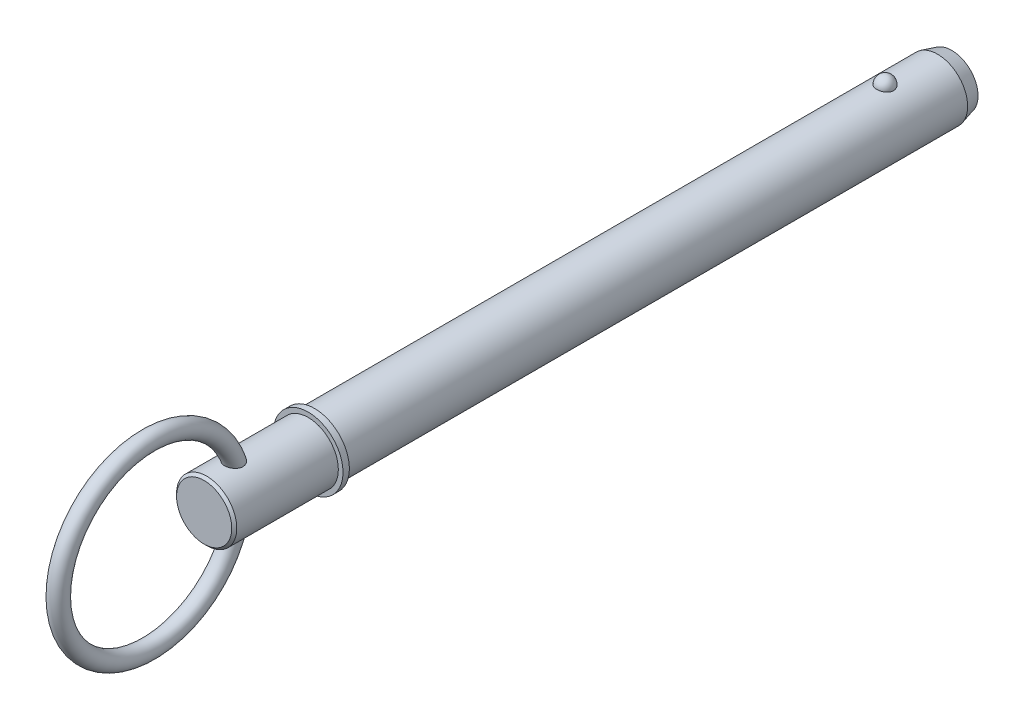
ISO-10303-21;
HEADER;
FILE_DESCRIPTION(('STEP AP214'),'2;1');
FILE_NAME('part.step','',(''),(''),'','','');
FILE_SCHEMA(('AUTOMOTIVE_DESIGN { 1 0 10303 214 1 1 1 1 }'));
ENDSEC;
DATA;
#1=APPLICATION_CONTEXT('core data for automotive mechanical design processes');
#2=APPLICATION_PROTOCOL_DEFINITION('international standard','automotive_design',2000,#1);
#3=PRODUCT_CONTEXT('',#1,'mechanical');
#4=PRODUCT('Part','Part','',(#3));
#5=PRODUCT_RELATED_PRODUCT_CATEGORY('part','',(#4));
#6=PRODUCT_DEFINITION_FORMATION('','',#4);
#7=PRODUCT_DEFINITION_CONTEXT('part definition',#1,'design');
#8=PRODUCT_DEFINITION('design','',#6,#7);
#9=PRODUCT_DEFINITION_SHAPE('','',#8);
#10=(LENGTH_UNIT() NAMED_UNIT(*) SI_UNIT(.MILLI.,.METRE.));
#11=(NAMED_UNIT(*) PLANE_ANGLE_UNIT() SI_UNIT($,.RADIAN.));
#12=(NAMED_UNIT(*) SI_UNIT($,.STERADIAN.) SOLID_ANGLE_UNIT());
#13=UNCERTAINTY_MEASURE_WITH_UNIT(LENGTH_MEASURE(1.E-05),#10,'distance_accuracy_value','');
#14=(GEOMETRIC_REPRESENTATION_CONTEXT(3) GLOBAL_UNCERTAINTY_ASSIGNED_CONTEXT((#13)) GLOBAL_UNIT_ASSIGNED_CONTEXT((#10,
#11,#12)) REPRESENTATION_CONTEXT('',''));
#15=CARTESIAN_POINT('',(0.,0.,0.));
#16=DIRECTION('',(0.,0.,1.));
#17=DIRECTION('',(1.,0.,0.));
#18=AXIS2_PLACEMENT_3D('',#15,#16,#17);
#19=CARTESIAN_POINT('',(0.,0.,177.8));
#20=DIRECTION('',(0.,0.,-1.));
#21=DIRECTION('',(-1.,0.,0.));
#22=AXIS2_PLACEMENT_3D('',#19,#20,#21);
#23=CYLINDRICAL_SURFACE('',#22,9.525);
#24=CARTESIAN_POINT('',(2.66304631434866,9.14515223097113,-2.68999999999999));
#25=CARTESIAN_POINT('',(2.66304388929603,9.14515434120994,-2.53964785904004));
#26=CARTESIAN_POINT('',(2.65079171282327,9.14874785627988,-2.38926509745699));
#27=CARTESIAN_POINT('',(2.60207590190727,9.16272073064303,-2.09276319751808));
#28=CARTESIAN_POINT('',(2.5656035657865,9.17310252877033,-1.94664561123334));
#29=CARTESIAN_POINT('',(2.469373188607,9.19947238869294,-1.66290124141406));
#30=CARTESIAN_POINT('',(2.40962536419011,9.215457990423,-1.52527076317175));
#31=CARTESIAN_POINT('',(2.26832639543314,9.25124900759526,-1.26225231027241));
#32=CARTESIAN_POINT('',(2.1867756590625,9.27105435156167,-1.13686410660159));
#33=CARTESIAN_POINT('',(2.00344089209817,9.3123948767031,-0.901158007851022));
#34=CARTESIAN_POINT('',(1.90155748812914,9.33393823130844,-0.790918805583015));
#35=CARTESIAN_POINT('',(1.68043702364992,9.37626794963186,-0.589299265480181));
#36=CARTESIAN_POINT('',(1.56119995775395,9.397054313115,-0.497918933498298));
#37=CARTESIAN_POINT('',(1.30893044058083,9.43549335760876,-0.336812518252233));
#38=CARTESIAN_POINT('',(1.17593917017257,9.45315498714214,-0.267024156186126));
#39=CARTESIAN_POINT('',(0.8995966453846,9.48344056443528,-0.150749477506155));
#40=CARTESIAN_POINT('',(0.756246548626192,9.49606507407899,-0.104260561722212));
#41=CARTESIAN_POINT('',(0.466048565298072,9.51468193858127,-0.0365733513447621));
#42=CARTESIAN_POINT('',(0.319312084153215,9.52079100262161,-0.014929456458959));
#43=CARTESIAN_POINT('',(0.0241592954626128,9.52611235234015,0.00395337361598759));
#44=CARTESIAN_POINT('',(-0.124256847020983,9.5253253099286,0.00119468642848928));
#45=CARTESIAN_POINT('',(-0.41628168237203,9.51700443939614,-0.0284230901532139));
#46=CARTESIAN_POINT('',(-0.559928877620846,9.50956858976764,-0.0549321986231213));
#47=CARTESIAN_POINT('',(-0.840604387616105,9.48887888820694,-0.130816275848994));
#48=CARTESIAN_POINT('',(-0.977632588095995,9.47562493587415,-0.180191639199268));
#49=CARTESIAN_POINT('',(-1.24212223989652,9.44460733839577,-0.300803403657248));
#50=CARTESIAN_POINT('',(-1.36952298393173,9.42681774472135,-0.372166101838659));
#51=CARTESIAN_POINT('',(-1.61053183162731,9.38864858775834,-0.534729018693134));
#52=CARTESIAN_POINT('',(-1.72413851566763,9.36826875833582,-0.625931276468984));
#53=CARTESIAN_POINT('',(-1.9367483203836,9.32666137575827,-0.827716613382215));
#54=CARTESIAN_POINT('',(-2.03542624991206,9.3054250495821,-0.938640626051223));
#55=CARTESIAN_POINT('',(-2.21301001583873,9.26480083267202,-1.17562728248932));
#56=CARTESIAN_POINT('',(-2.29191442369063,9.24541307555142,-1.3016910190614));
#57=CARTESIAN_POINT('',(-2.4288038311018,9.21040769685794,-1.56709947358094));
#58=CARTESIAN_POINT('',(-2.48653332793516,9.19483682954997,-1.70658229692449));
#59=CARTESIAN_POINT('',(-2.57830950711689,9.16952722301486,-1.99363485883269));
#60=CARTESIAN_POINT('',(-2.61235688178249,9.1597883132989,-2.14120436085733));
#61=CARTESIAN_POINT('',(-2.65582131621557,9.14728131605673,-2.43957517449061));
#62=CARTESIAN_POINT('',(-2.66534248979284,9.14448376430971,-2.59036007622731));
#63=CARTESIAN_POINT('',(-2.659816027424,9.1460926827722,-2.89143694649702));
#64=CARTESIAN_POINT('',(-2.64476907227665,9.15049895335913,-3.04172892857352));
#65=CARTESIAN_POINT('',(-2.59062526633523,9.16597303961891,-3.3367616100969));
#66=CARTESIAN_POINT('',(-2.55165119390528,9.17700684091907,-3.48152666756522));
#67=CARTESIAN_POINT('',(-2.45072334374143,9.20447158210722,-3.7622672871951));
#68=CARTESIAN_POINT('',(-2.38876863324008,9.22090274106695,-3.89824249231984));
#69=CARTESIAN_POINT('',(-2.24300082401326,9.25744165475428,-4.15838266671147));
#70=CARTESIAN_POINT('',(-2.15906901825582,9.27756919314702,-4.28247834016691));
#71=CARTESIAN_POINT('',(-1.97161008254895,9.31920445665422,-4.51460755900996));
#72=CARTESIAN_POINT('',(-1.86808218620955,9.34071223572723,-4.62264047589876));
#73=CARTESIAN_POINT('',(-1.64365852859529,9.38280712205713,-4.82005417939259));
#74=CARTESIAN_POINT('',(-1.52269814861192,9.40339041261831,-4.90936239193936));
#75=CARTESIAN_POINT('',(-1.26696810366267,9.44124442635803,-5.06628635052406));
#76=CARTESIAN_POINT('',(-1.13219941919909,9.45851538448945,-5.13390363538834));
#77=CARTESIAN_POINT('',(-0.854427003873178,9.48761400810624,-5.24478918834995));
#78=CARTESIAN_POINT('',(-0.711548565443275,9.49950757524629,-5.28835378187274));
#79=CARTESIAN_POINT('',(-0.420167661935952,9.51684639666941,-5.35116010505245));
#80=CARTESIAN_POINT('',(-0.271665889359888,9.52229244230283,-5.3704048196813));
#81=CARTESIAN_POINT('',(0.0236961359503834,9.52609381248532,-5.38387805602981));
#82=CARTESIAN_POINT('',(0.170533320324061,9.52458300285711,-5.37857884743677));
#83=CARTESIAN_POINT('',(0.461166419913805,9.51494050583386,-5.34419624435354));
#84=CARTESIAN_POINT('',(0.604962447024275,9.50680906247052,-5.31511372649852));
#85=CARTESIAN_POINT('',(0.884899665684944,9.48484202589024,-5.23415185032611));
#86=CARTESIAN_POINT('',(1.02106863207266,9.47102889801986,-5.18236222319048));
#87=CARTESIAN_POINT('',(1.28268503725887,9.43915933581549,-5.05742910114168));
#88=CARTESIAN_POINT('',(1.40813178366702,9.421102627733,-4.98428422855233));
#89=CARTESIAN_POINT('',(1.64690915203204,9.38233399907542,-4.8172920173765));
#90=CARTESIAN_POINT('',(1.76002050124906,9.36158508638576,-4.72313982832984));
#91=CARTESIAN_POINT('',(1.96897358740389,9.31987907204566,-4.51732444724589));
#92=CARTESIAN_POINT('',(2.06481234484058,9.29892193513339,-4.40565824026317));
#93=CARTESIAN_POINT('',(2.23837433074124,9.25869342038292,-4.16566572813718));
#94=CARTESIAN_POINT('',(2.31574652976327,9.23945848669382,-4.03707931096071));
#95=CARTESIAN_POINT('',(2.44818540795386,9.20525491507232,-3.76840633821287));
#96=CARTESIAN_POINT('',(2.50325979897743,9.19028480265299,-3.6283237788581));
#97=CARTESIAN_POINT('',(2.58510224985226,9.16757716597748,-3.35610038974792));
#98=CARTESIAN_POINT('',(2.61427951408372,9.15923447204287,-3.2247283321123));
#99=CARTESIAN_POINT('',(2.6532524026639,9.14802112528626,-2.95891229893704));
#100=CARTESIAN_POINT('',(2.66304848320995,9.1451503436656,-2.82446839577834));
#101=CARTESIAN_POINT('',(2.66304631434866,9.14515223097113,-2.68999999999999));
#102=B_SPLINE_CURVE_WITH_KNOTS('',3,(#24,#25,#26,#27,#28,#29,#30,#31,#32,#33,#34,#35,#36,#37,
#38,#39,#40,#41,#42,#43,#44,#45,#46,#47,#48,#49,#50,#51,#52,#53,#54,#55,#56,#57,#58,#59,#60,#61,
#62,#63,#64,#65,#66,#67,#68,#69,#70,#71,#72,#73,#74,#75,#76,#77,#78,#79,#80,#81,#82,#83,#84,#85,
#86,#87,#88,#89,#90,#91,#92,#93,#94,#95,#96,#97,#98,#99,#100,#101),.UNSPECIFIED.,.T.,.F.,(4,2,2,
2,2,2,2,2,2,2,2,2,2,2,2,2,2,2,2,2,2,2,2,2,2,2,2,2,2,2,2,2,2,2,2,2,2,2,4),(0.,0.450573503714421,
0.901308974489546,1.35184682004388,1.80237623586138,2.25516399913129,2.70795190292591,
3.15942136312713,3.61084044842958,4.0540301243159,4.49717661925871,4.9338984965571,
5.37062791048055,5.80991423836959,6.24924573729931,6.69708004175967,7.1449466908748,
7.5980522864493,8.0511446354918,8.50231041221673,8.95346368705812,9.40232106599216,
9.85119666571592,10.3025487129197,10.7539184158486,11.2070064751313,11.6600623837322,
12.1074045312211,12.5546917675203,12.9934085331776,13.4321091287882,13.8690915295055,
14.3061021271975,14.7499227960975,15.1938199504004,15.6455814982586,16.0971866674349,
16.5001694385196,16.9031427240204),.UNSPECIFIED.);
#103=CARTESIAN_POINT('',(2.66304631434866,9.14515223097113,-2.68999999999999));
#104=VERTEX_POINT('',#103);
#105=EDGE_CURVE('E103',#104,#104,#102,.T.);
#106=ORIENTED_EDGE('',*,*,#105,.T.);
#107=EDGE_LOOP('',(#106));
#108=FACE_BOUND('',#107,.T.);
#109=CARTESIAN_POINT('',(0.,0.,-19.3));
#110=DIRECTION('',(0.,0.,-1.));
#111=DIRECTION('',(-1.,0.,0.));
#112=AXIS2_PLACEMENT_3D('',#109,#110,#111);
#113=CIRCLE('',#112,9.525);
#114=CARTESIAN_POINT('',(-9.525,0.,-19.3));
#115=VERTEX_POINT('',#114);
#116=EDGE_CURVE('E110',#115,#115,#113,.F.);
#117=ORIENTED_EDGE('',*,*,#116,.T.);
#118=EDGE_LOOP('',(#117));
#119=FACE_BOUND('',#118,.T.);
#120=CARTESIAN_POINT('',(0.,0.,177.8));
#121=DIRECTION('',(0.,0.,1.));
#122=DIRECTION('',(1.,0.,0.));
#123=AXIS2_PLACEMENT_3D('',#120,#121,#122);
#124=CIRCLE('',#123,9.525);
#125=CARTESIAN_POINT('',(9.525,0.,177.8));
#126=VERTEX_POINT('',#125);
#127=EDGE_CURVE('E108',#126,#126,#124,.T.);
#128=ORIENTED_EDGE('',*,*,#127,.F.);
#129=EDGE_LOOP('',(#128));
#130=FACE_BOUND('',#129,.T.);
#131=ADVANCED_FACE('F39',(#108,#119,#130),#23,.T.);
#132=CARTESIAN_POINT('',(0.,0.,-23.8));
#133=DIRECTION('',(0.,0.,-1.));
#134=DIRECTION('',(-1.,0.,0.));
#135=AXIS2_PLACEMENT_3D('',#132,#133,#134);
#136=PLANE('',#135);
#137=CARTESIAN_POINT('',(0.,0.,-23.8));
#138=DIRECTION('',(0.,0.,-1.));
#139=DIRECTION('',(-1.,0.,0.));
#140=AXIS2_PLACEMENT_3D('',#137,#138,#139);
#141=CIRCLE('',#140,8.31922863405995);
#142=CARTESIAN_POINT('',(-8.31922863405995,0.,-23.8));
#143=VERTEX_POINT('',#142);
#144=EDGE_CURVE('E142',#143,#143,#141,.T.);
#145=ORIENTED_EDGE('',*,*,#144,.T.);
#146=EDGE_LOOP('',(#145));
#147=FACE_BOUND('',#146,.T.);
#148=ADVANCED_FACE('F89',(#147),#136,.T.);
#149=CARTESIAN_POINT('',(0.,0.,-23.8));
#150=DIRECTION('',(0.,0.,1.));
#151=DIRECTION('',(1.,0.,0.));
#152=AXIS2_PLACEMENT_3D('',#149,#150,#151);
#153=CONICAL_SURFACE('',#152,8.31922863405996,0.261799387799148);
#154=ORIENTED_EDGE('',*,*,#116,.F.);
#155=EDGE_LOOP('',(#154));
#156=FACE_BOUND('',#155,.T.);
#157=ORIENTED_EDGE('',*,*,#144,.F.);
#158=EDGE_LOOP('',(#157));
#159=FACE_BOUND('',#158,.T.);
#160=ADVANCED_FACE('F95',(#156,#159),#153,.T.);
#161=CARTESIAN_POINT('',(0.,9.525,-2.68999999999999));
#162=DIRECTION('',(0.,1.,0.));
#163=DIRECTION('',(0.,0.,1.));
#164=AXIS2_PLACEMENT_3D('',#161,#162,#163);
#165=SPHERICAL_SURFACE('',#164,2.69);
#166=ORIENTED_EDGE('',*,*,#105,.F.);
#167=EDGE_LOOP('',(#166));
#168=FACE_BOUND('',#167,.T.);
#169=ADVANCED_FACE('F113',(#168),#165,.T.);
#170=CARTESIAN_POINT('',(0.,0.,177.8));
#171=DIRECTION('',(0.,0.,-1.));
#172=DIRECTION('',(-1.,0.,0.));
#173=AXIS2_PLACEMENT_3D('',#170,#171,#172);
#174=PLANE('',#173);
#175=ORIENTED_EDGE('',*,*,#127,.T.);
#176=EDGE_LOOP('',(#175));
#177=FACE_BOUND('',#176,.T.);
#178=CARTESIAN_POINT('',(0.,0.,177.8));
#179=DIRECTION('',(0.,0.,-1.));
#180=DIRECTION('',(-1.,0.,0.));
#181=AXIS2_PLACEMENT_3D('',#178,#179,#180);
#182=CIRCLE('',#181,11.);
#183=CARTESIAN_POINT('',(-11.,0.,177.8));
#184=VERTEX_POINT('',#183);
#185=EDGE_CURVE('E109',#184,#184,#182,.T.);
#186=ORIENTED_EDGE('',*,*,#185,.T.);
#187=EDGE_LOOP('',(#186));
#188=FACE_BOUND('',#187,.T.);
#189=ADVANCED_FACE('F117',(#177,#188),#174,.T.);
#190=CARTESIAN_POINT('',(0.,0.,33.7287874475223));
#191=DIRECTION('',(0.,0.,-1.));
#192=DIRECTION('',(-1.,0.,0.));
#193=AXIS2_PLACEMENT_3D('',#190,#191,#192);
#194=CYLINDRICAL_SURFACE('',#193,11.);
#195=CARTESIAN_POINT('',(0.,0.,179.8));
#196=DIRECTION('',(0.,0.,-1.));
#197=DIRECTION('',(-1.,0.,0.));
#198=AXIS2_PLACEMENT_3D('',#195,#196,#197);
#199=CIRCLE('',#198,11.);
#200=CARTESIAN_POINT('',(-11.,0.,179.8));
#201=VERTEX_POINT('',#200);
#202=EDGE_CURVE('E134',#201,#201,#199,.T.);
#203=ORIENTED_EDGE('',*,*,#202,.T.);
#204=EDGE_LOOP('',(#203));
#205=FACE_BOUND('',#204,.T.);
#206=ORIENTED_EDGE('',*,*,#185,.F.);
#207=EDGE_LOOP('',(#206));
#208=FACE_BOUND('',#207,.T.);
#209=ADVANCED_FACE('F121',(#205,#208),#194,.T.);
#210=CARTESIAN_POINT('',(0.,11.,179.8));
#211=DIRECTION('',(0.,0.,1.));
#212=DIRECTION('',(1.,0.,0.));
#213=AXIS2_PLACEMENT_3D('',#210,#211,#212);
#214=PLANE('',#213);
#215=CARTESIAN_POINT('',(0.,0.,179.8));
#216=DIRECTION('',(0.,0.,1.));
#217=DIRECTION('',(1.,0.,0.));
#218=AXIS2_PLACEMENT_3D('',#215,#216,#217);
#219=CIRCLE('',#218,9.525);
#220=CARTESIAN_POINT('',(9.525,0.,179.8));
#221=VERTEX_POINT('',#220);
#222=EDGE_CURVE('E112',#221,#221,#219,.T.);
#223=ORIENTED_EDGE('',*,*,#222,.F.);
#224=EDGE_LOOP('',(#223));
#225=FACE_BOUND('',#224,.T.);
#226=ORIENTED_EDGE('',*,*,#202,.F.);
#227=EDGE_LOOP('',(#226));
#228=FACE_BOUND('',#227,.T.);
#229=ADVANCED_FACE('F86',(#225,#228),#214,.T.);
#230=CARTESIAN_POINT('',(0.,0.,212.73));
#231=DIRECTION('',(0.,0.,-1.));
#232=DIRECTION('',(-1.,0.,0.));
#233=AXIS2_PLACEMENT_3D('',#230,#231,#232);
#234=CYLINDRICAL_SURFACE('',#233,9.525);
#235=CARTESIAN_POINT('',(-1.17255022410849,-9.45255262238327,200.715681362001));
#236=CARTESIAN_POINT('',(-1.03279041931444,-9.46988901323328,200.652058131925));
#237=CARTESIAN_POINT('',(-0.887457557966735,-9.48474288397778,200.600036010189));
#238=CARTESIAN_POINT('',(-0.589790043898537,-9.50789357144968,200.520301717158));
#239=CARTESIAN_POINT('',(-0.437456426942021,-9.51619135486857,200.492585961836));
#240=CARTESIAN_POINT('',(-0.130095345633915,-9.52535230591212,200.462037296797));
#241=CARTESIAN_POINT('',(0.0249321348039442,-9.52621542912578,200.459204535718));
#242=CARTESIAN_POINT('',(0.333291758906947,-9.5204161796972,200.478480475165));
#243=CARTESIAN_POINT('',(0.486623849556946,-9.51375357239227,200.500589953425));
#244=CARTESIAN_POINT('',(0.78732615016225,-9.49360162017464,200.569309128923));
#245=CARTESIAN_POINT('',(0.934692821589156,-9.48010828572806,200.615933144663));
#246=CARTESIAN_POINT('',(1.21917062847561,-9.44773819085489,200.732695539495));
#247=CARTESIAN_POINT('',(1.35628163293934,-9.42886136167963,200.802834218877));
#248=CARTESIAN_POINT('',(1.61597534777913,-9.38783836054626,200.964858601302));
#249=CARTESIAN_POINT('',(1.73859309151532,-9.36570037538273,201.056690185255));
#250=CARTESIAN_POINT('',(1.96611924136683,-9.32059424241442,201.259983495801));
#251=CARTESIAN_POINT('',(2.07103000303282,-9.29762620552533,201.371442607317));
#252=CARTESIAN_POINT('',(2.25895856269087,-9.25375378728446,201.609567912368));
#253=CARTESIAN_POINT('',(2.34223089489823,-9.23282741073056,201.736029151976));
#254=CARTESIAN_POINT('',(2.48638570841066,-9.19505802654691,202.001654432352));
#255=CARTESIAN_POINT('',(2.54727152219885,-9.17821441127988,202.140816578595));
#256=CARTESIAN_POINT('',(2.64504150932,-9.15051673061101,202.426450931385));
#257=CARTESIAN_POINT('',(2.68213620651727,-9.13961026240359,202.57284631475));
#258=CARTESIAN_POINT('',(2.73308631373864,-9.1245038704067,202.869935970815));
#259=CARTESIAN_POINT('',(2.74693762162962,-9.12030513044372,203.020630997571));
#260=CARTESIAN_POINT('',(2.75225289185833,-9.11870262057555,203.328204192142));
#261=CARTESIAN_POINT('',(2.742835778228,-9.12156626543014,203.485097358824));
#262=CARTESIAN_POINT('',(2.70120500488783,-9.1339786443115,203.79553038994));
#263=CARTESIAN_POINT('',(2.66898313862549,-9.14352978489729,203.949069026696));
#264=CARTESIAN_POINT('',(2.57915721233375,-9.1692947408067,204.264317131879));
#265=CARTESIAN_POINT('',(2.51938387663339,-9.18606757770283,204.42536274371));
#266=CARTESIAN_POINT('',(2.37615490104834,-9.22415241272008,204.736112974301));
#267=CARTESIAN_POINT('',(2.29267648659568,-9.2454687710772,204.885806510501));
#268=CARTESIAN_POINT('',(2.09570343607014,-9.29218719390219,205.182005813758));
#269=CARTESIAN_POINT('',(1.98029238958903,-9.31778152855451,205.327215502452));
#270=CARTESIAN_POINT('',(1.72523060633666,-9.36835235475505,205.594631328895));
#271=CARTESIAN_POINT('',(1.58560973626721,-9.39332956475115,205.71686542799));
#272=CARTESIAN_POINT('',(1.31999418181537,-9.43381163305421,205.906542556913));
#273=CARTESIAN_POINT('',(1.1984987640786,-9.45016352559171,205.980111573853));
#274=CARTESIAN_POINT('',(0.9447269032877,-9.47889043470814,206.106555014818));
#275=CARTESIAN_POINT('',(0.812460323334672,-9.4912690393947,206.15944811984));
#276=CARTESIAN_POINT('',(0.539385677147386,-9.51070487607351,206.241579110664));
#277=CARTESIAN_POINT('',(0.398529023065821,-9.51772807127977,206.270665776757));
#278=CARTESIAN_POINT('',(0.113692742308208,-9.52538430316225,206.30234627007));
#279=CARTESIAN_POINT('',(-0.0302854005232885,-9.52602031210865,206.304952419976));
#280=CARTESIAN_POINT('',(-0.301067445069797,-9.52110324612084,206.284638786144));
#281=CARTESIAN_POINT('',(-0.428091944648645,-9.51619084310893,206.264361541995));
#282=CARTESIAN_POINT('',(-0.676960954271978,-9.50173118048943,206.203770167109));
#283=CARTESIAN_POINT('',(-0.79880468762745,-9.49218322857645,206.163453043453));
#284=CARTESIAN_POINT('',(-1.03743276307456,-9.4691126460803,206.063797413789));
#285=CARTESIAN_POINT('',(-1.15402581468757,-9.45550022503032,206.004026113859));
#286=CARTESIAN_POINT('',(-1.37707059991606,-9.42560278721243,205.868465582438));
#287=CARTESIAN_POINT('',(-1.48351822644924,-9.40931669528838,205.792669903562));
#288=CARTESIAN_POINT('',(-1.70022776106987,-9.37276249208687,205.615206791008));
#289=CARTESIAN_POINT('',(-1.80866644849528,-9.35226352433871,205.511363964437));
#290=CARTESIAN_POINT('',(-2.00947431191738,-9.31118474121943,205.28916467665));
#291=CARTESIAN_POINT('',(-2.10183201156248,-9.29060487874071,205.170797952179));
#292=CARTESIAN_POINT('',(-2.28343646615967,-9.24779116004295,204.901723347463));
#293=CARTESIAN_POINT('',(-2.36963977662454,-9.22584708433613,204.748904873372));
#294=CARTESIAN_POINT('',(-2.51731958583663,-9.18665215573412,204.431108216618));
#295=CARTESIAN_POINT('',(-2.57878214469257,-9.16940395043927,204.266123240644));
#296=CARTESIAN_POINT('',(-2.67771284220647,-9.14102404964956,203.917906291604));
#297=CARTESIAN_POINT('',(-2.71355979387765,-9.13031106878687,203.734171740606));
#298=CARTESIAN_POINT('',(-2.75239325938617,-9.11868499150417,203.362939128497));
#299=CARTESIAN_POINT('',(-2.75540326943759,-9.11776488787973,203.175443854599));
#300=CARTESIAN_POINT('',(-2.72755769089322,-9.12612848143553,202.818233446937));
#301=CARTESIAN_POINT('',(-2.69938579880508,-9.1346036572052,202.648293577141));
#302=CARTESIAN_POINT('',(-2.61282341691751,-9.15973790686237,202.31694195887));
#303=CARTESIAN_POINT('',(-2.5544530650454,-9.17639152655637,202.155524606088));
#304=CARTESIAN_POINT('',(-2.41575064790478,-9.21381352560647,201.862262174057));
#305=CARTESIAN_POINT('',(-2.33810564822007,-9.23402440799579,201.729067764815));
#306=CARTESIAN_POINT('',(-2.1611059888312,-9.27704240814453,201.478436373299));
#307=CARTESIAN_POINT('',(-2.06174995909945,-9.29984968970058,201.36100038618));
#308=CARTESIAN_POINT('',(-1.84046167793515,-9.34620233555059,201.141444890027));
#309=CARTESIAN_POINT('',(-1.71787459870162,-9.36974632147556,201.03998498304));
#310=CARTESIAN_POINT('',(-1.45637301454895,-9.41393415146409,200.860085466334));
#311=CARTESIAN_POINT('',(-1.31745717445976,-9.43457775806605,200.781647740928));
#312=CARTESIAN_POINT('',(-1.17255022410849,-9.45255262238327,200.715681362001));
#313=B_SPLINE_CURVE_WITH_KNOTS('',3,(#235,#236,#237,#238,#239,#240,#241,#242,#243,#244,#245,
#246,#247,#248,#249,#250,#251,#252,#253,#254,#255,#256,#257,#258,#259,#260,#261,#262,#263,#264,
#265,#266,#267,#268,#269,#270,#271,#272,#273,#274,#275,#276,#277,#278,#279,#280,#281,#282,#283,
#284,#285,#286,#287,#288,#289,#290,#291,#292,#293,#294,#295,#296,#297,#298,#299,#300,#301,#302,
#303,#304,#305,#306,#307,#308,#309,#310,#311,#312),.UNSPECIFIED.,.T.,.F.,(4,2,2,2,2,2,2,2,2,2,2,
2,2,2,2,2,2,2,2,2,2,2,2,2,2,2,2,2,2,2,2,2,2,2,2,2,2,2,4),(0.,0.463035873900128,
0.926003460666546,1.38897381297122,1.8519586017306,2.31521411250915,2.77847553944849,
3.24059321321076,3.70264936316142,4.15899535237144,4.61527338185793,5.06745604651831,
5.51971850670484,5.98936669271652,6.45918397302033,6.97482863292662,7.49097038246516,
8.04995658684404,8.60825803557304,9.03545685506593,9.462268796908,9.89177127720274,
10.3210738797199,10.7054535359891,11.0898906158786,11.4835430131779,11.8773540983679,
12.3302409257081,12.7834496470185,13.3116493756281,13.8401462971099,14.3996817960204,
14.9588168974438,15.4733264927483,15.9874934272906,16.4516692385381,16.915874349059,
17.3959238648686,17.8760126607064),.UNSPECIFIED.);
#314=CARTESIAN_POINT('',(-1.17255022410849,-9.45255262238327,200.715681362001));
#315=VERTEX_POINT('',#314);
#316=EDGE_CURVE('E10',#315,#315,#313,.T.);
#317=ORIENTED_EDGE('',*,*,#316,.F.);
#318=EDGE_LOOP('',(#317));
#319=FACE_BOUND('',#318,.T.);
#320=CARTESIAN_POINT('',(-1.17255022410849,9.45255262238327,200.715681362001));
#321=CARTESIAN_POINT('',(-1.31058061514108,9.43543238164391,200.778514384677));
#322=CARTESIAN_POINT('',(-1.44315063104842,9.41589375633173,200.852651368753));
#323=CARTESIAN_POINT('',(-1.69365345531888,9.37407591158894,201.021892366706));
#324=CARTESIAN_POINT('',(-1.81158925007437,9.35179725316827,201.116992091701));
#325=CARTESIAN_POINT('',(-2.02956633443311,9.30692788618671,201.32596768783));
#326=CARTESIAN_POINT('',(-2.12959463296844,9.28433696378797,201.439857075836));
#327=CARTESIAN_POINT('',(-2.30883055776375,9.24139869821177,201.68334578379));
#328=CARTESIAN_POINT('',(-2.38804080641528,9.22105107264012,201.812943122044));
#329=CARTESIAN_POINT('',(-2.52289811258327,9.18506690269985,202.082637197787));
#330=CARTESIAN_POINT('',(-2.57879510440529,9.16938093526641,202.222602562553));
#331=CARTESIAN_POINT('',(-2.66732862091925,9.14402087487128,202.510194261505));
#332=CARTESIAN_POINT('',(-2.6999643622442,9.13434698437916,202.657820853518));
#333=CARTESIAN_POINT('',(-2.74234854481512,9.12171311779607,202.958709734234));
#334=CARTESIAN_POINT('',(-2.75176419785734,9.11885078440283,203.112022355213));
#335=CARTESIAN_POINT('',(-2.74768995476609,9.12007747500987,203.418282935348));
#336=CARTESIAN_POINT('',(-2.73419331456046,9.12416854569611,203.571230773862));
#337=CARTESIAN_POINT('',(-2.6838140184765,9.13911977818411,203.885048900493));
#338=CARTESIAN_POINT('',(-2.64520186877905,9.15047943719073,204.045615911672));
#339=CARTESIAN_POINT('',(-2.54485320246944,9.17889121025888,204.358878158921));
#340=CARTESIAN_POINT('',(-2.48309922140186,9.19594762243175,204.511567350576));
#341=CARTESIAN_POINT('',(-2.33056913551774,9.23584987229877,204.821122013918));
#342=CARTESIAN_POINT('',(-2.23745101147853,9.25911216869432,204.976784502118));
#343=CARTESIAN_POINT('',(-2.02674425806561,9.307501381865,205.270279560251));
#344=CARTESIAN_POINT('',(-1.90916388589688,9.33262766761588,205.408118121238));
#345=CARTESIAN_POINT('',(-1.67044606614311,9.37804498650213,205.642015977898));
#346=CARTESIAN_POINT('',(-1.55243875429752,9.39849934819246,205.741240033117));
#347=CARTESIAN_POINT('',(-1.30125310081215,9.43654625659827,205.919193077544));
#348=CARTESIAN_POINT('',(-1.16808326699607,9.45414039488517,205.997933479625));
#349=CARTESIAN_POINT('',(-0.958516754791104,9.47691412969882,206.097606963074));
#350=CARTESIAN_POINT('',(-0.886649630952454,9.48392776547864,206.127860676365));
#351=CARTESIAN_POINT('',(-0.740281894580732,9.49647248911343,206.181484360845));
#352=CARTESIAN_POINT('',(-0.665782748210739,9.50200438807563,206.204858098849));
#353=CARTESIAN_POINT('',(-0.514804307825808,9.51137811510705,206.2442294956));
#354=CARTESIAN_POINT('',(-0.438326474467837,9.51522115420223,206.260232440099));
#355=CARTESIAN_POINT('',(-0.284116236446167,9.52107513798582,206.284532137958));
#356=CARTESIAN_POINT('',(-0.206384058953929,9.52308641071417,206.292830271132));
#357=CARTESIAN_POINT('',(0.00463957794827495,9.5259225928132,206.30454519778));
#358=CARTESIAN_POINT('',(0.1384605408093,9.52491109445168,206.300394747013));
#359=CARTESIAN_POINT('',(0.40315259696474,9.51738801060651,206.269251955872));
#360=CARTESIAN_POINT('',(0.53402383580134,9.51087669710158,206.242260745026));
#361=CARTESIAN_POINT('',(0.783985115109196,9.49347484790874,206.168806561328));
#362=CARTESIAN_POINT('',(0.903337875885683,9.48277338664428,206.123181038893));
#363=CARTESIAN_POINT('',(1.1336366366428,9.45800893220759,206.014928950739));
#364=CARTESIAN_POINT('',(1.24458027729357,9.44394500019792,205.952297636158));
#365=CARTESIAN_POINT('',(1.46880911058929,9.41182796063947,205.804389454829));
#366=CARTESIAN_POINT('',(1.58087386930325,9.3935013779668,205.717328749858));
#367=CARTESIAN_POINT('',(1.79132420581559,9.35565274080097,205.528247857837));
#368=CARTESIAN_POINT('',(1.88970126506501,9.33612995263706,205.426218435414));
#369=CARTESIAN_POINT('',(2.08778125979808,9.29401761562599,205.190997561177));
#370=CARTESIAN_POINT('',(2.18473298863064,9.27148591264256,205.05547341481));
#371=CARTESIAN_POINT('',(2.35733954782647,9.22911075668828,204.771030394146));
#372=CARTESIAN_POINT('',(2.43297838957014,9.20926932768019,204.622101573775));
#373=CARTESIAN_POINT('',(2.56843139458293,9.17247322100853,204.297269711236));
#374=CARTESIAN_POINT('',(2.6256192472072,9.15606955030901,204.120196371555));
#375=CARTESIAN_POINT('',(2.70930664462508,9.13166037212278,203.758330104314));
#376=CARTESIAN_POINT('',(2.73581406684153,9.12365270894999,203.573539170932));
#377=CARTESIAN_POINT('',(2.7551261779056,9.11784049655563,203.209017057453));
#378=CARTESIAN_POINT('',(2.74917791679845,9.11965839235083,203.029361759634));
#379=CARTESIAN_POINT('',(2.70473277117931,9.13294027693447,202.674499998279));
#380=CARTESIAN_POINT('',(2.66626406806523,9.14439591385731,202.499289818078));
#381=CARTESIAN_POINT('',(2.56263844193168,9.17393184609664,202.178469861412));
#382=CARTESIAN_POINT('',(2.50080069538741,9.19116614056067,202.031704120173));
#383=CARTESIAN_POINT('',(2.35244847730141,9.23024728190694,201.75189992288));
#384=CARTESIAN_POINT('',(2.26593972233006,9.25209305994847,201.618858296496));
#385=CARTESIAN_POINT('',(2.07585352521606,9.29652853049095,201.377145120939));
#386=CARTESIAN_POINT('',(1.97340753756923,9.31901931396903,201.267562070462));
#387=CARTESIAN_POINT('',(1.75142335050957,9.36327537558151,201.067179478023));
#388=CARTESIAN_POINT('',(1.63188535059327,9.38504066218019,200.976379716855));
#389=CARTESIAN_POINT('',(1.37826267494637,9.42563474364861,200.815168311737));
#390=CARTESIAN_POINT('',(1.24409194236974,9.44444438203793,200.744887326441));
#391=CARTESIAN_POINT('',(0.965562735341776,9.47697010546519,200.626996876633));
#392=CARTESIAN_POINT('',(0.821203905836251,9.4906860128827,200.579388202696));
#393=CARTESIAN_POINT('',(0.524366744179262,9.51173338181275,200.507369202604));
#394=CARTESIAN_POINT('',(0.371807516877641,9.5189799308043,200.483267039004));
#395=CARTESIAN_POINT('',(0.0646112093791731,9.52602042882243,200.459842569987));
#396=CARTESIAN_POINT('',(-0.0900262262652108,9.52581308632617,200.460524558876));
#397=CARTESIAN_POINT('',(-0.404139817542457,9.51777767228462,200.487276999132));
#398=CARTESIAN_POINT('',(-0.563508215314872,9.50959696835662,200.514522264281));
#399=CARTESIAN_POINT('',(-0.874799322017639,9.48602809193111,200.595533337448));
#400=CARTESIAN_POINT('',(-1.02672214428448,9.47064002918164,200.64929874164));
#401=CARTESIAN_POINT('',(-1.17255022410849,9.45255262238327,200.715681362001));
#402=B_SPLINE_CURVE_WITH_KNOTS('',3,(#320,#321,#322,#323,#324,#325,#326,#327,#328,#329,#330,
#331,#332,#333,#334,#335,#336,#337,#338,#339,#340,#341,#342,#343,#344,#345,#346,#347,#348,#349,
#350,#351,#352,#353,#354,#355,#356,#357,#358,#359,#360,#361,#362,#363,#364,#365,#366,#367,#368,
#369,#370,#371,#372,#373,#374,#375,#376,#377,#378,#379,#380,#381,#382,#383,#384,#385,#386,#387,
#388,#389,#390,#391,#392,#393,#394,#395,#396,#397,#398,#399,#400,#401),.UNSPECIFIED.,.T.,.F.,(4,
2,2,2,2,2,2,2,2,2,2,2,2,2,2,2,2,2,2,2,2,2,2,2,2,2,2,2,2,2,2,2,2,2,2,2,2,2,2,2,4),(0.,
0.457306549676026,0.914519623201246,1.37206305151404,1.82954881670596,2.28199545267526,
2.73445732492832,3.19336710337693,3.65241198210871,4.14699278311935,4.64194758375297,
5.18812269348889,5.73411374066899,6.19889752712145,6.66342179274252,6.89799214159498,
7.13243382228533,7.36670711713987,7.60093844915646,8.00032434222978,8.39969048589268,
8.78279802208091,9.16601265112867,9.59366701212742,10.0215863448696,10.5240084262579,
11.0268064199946,11.5844522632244,12.1419548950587,12.6781910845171,13.213963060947,
13.6920531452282,14.1700325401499,14.6229745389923,15.0759112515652,15.5316722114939,
15.9874490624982,16.4491237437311,16.91087841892,17.3940267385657,17.8771677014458),.UNSPECIFIED.);
#403=CARTESIAN_POINT('',(-1.17255022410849,9.45255262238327,200.715681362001));
#404=VERTEX_POINT('',#403);
#405=EDGE_CURVE('E51',#404,#404,#402,.T.);
#406=ORIENTED_EDGE('',*,*,#405,.F.);
#407=EDGE_LOOP('',(#406));
#408=FACE_BOUND('',#407,.T.);
#409=CARTESIAN_POINT('',(0.,0.,211.93));
#410=DIRECTION('',(0.,0.,-1.));
#411=DIRECTION('',(-1.,0.,0.));
#412=AXIS2_PLACEMENT_3D('',#409,#410,#411);
#413=CIRCLE('',#412,9.525);
#414=CARTESIAN_POINT('',(-9.525,0.,211.93));
#415=VERTEX_POINT('',#414);
#416=EDGE_CURVE('E65',#415,#415,#413,.T.);
#417=ORIENTED_EDGE('',*,*,#416,.T.);
#418=EDGE_LOOP('',(#417));
#419=FACE_BOUND('',#418,.T.);
#420=ORIENTED_EDGE('',*,*,#222,.T.);
#421=EDGE_LOOP('',(#420));
#422=FACE_BOUND('',#421,.T.);
#423=ADVANCED_FACE('F70',(#319,#408,#419,#422),#234,.T.);
#424=CARTESIAN_POINT('',(0.,0.,212.73));
#425=DIRECTION('',(0.,0.,-1.));
#426=DIRECTION('',(-1.,0.,0.));
#427=AXIS2_PLACEMENT_3D('',#424,#425,#426);
#428=PLANE('',#427);
#429=CARTESIAN_POINT('',(0.,0.,212.73));
#430=DIRECTION('',(0.,0.,-1.));
#431=DIRECTION('',(-1.,0.,0.));
#432=AXIS2_PLACEMENT_3D('',#429,#430,#431);
#433=CIRCLE('',#432,8.72499999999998);
#434=CARTESIAN_POINT('',(-8.72499999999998,0.,212.73));
#435=VERTEX_POINT('',#434);
#436=EDGE_CURVE('E58',#435,#435,#433,.F.);
#437=ORIENTED_EDGE('',*,*,#436,.T.);
#438=EDGE_LOOP('',(#437));
#439=FACE_BOUND('',#438,.T.);
#440=ADVANCED_FACE('F77',(#439),#428,.F.);
#441=CARTESIAN_POINT('',(0.,0.,211.93));
#442=DIRECTION('',(0.,0.,-1.));
#443=DIRECTION('',(-1.,0.,0.));
#444=AXIS2_PLACEMENT_3D('',#441,#442,#443);
#445=CONICAL_SURFACE('',#444,9.525,0.785398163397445);
#446=ORIENTED_EDGE('',*,*,#436,.F.);
#447=EDGE_LOOP('',(#446));
#448=FACE_BOUND('',#447,.T.);
#449=ORIENTED_EDGE('',*,*,#416,.F.);
#450=EDGE_LOOP('',(#449));
#451=FACE_BOUND('',#450,.T.);
#452=ADVANCED_FACE('F41',(#448,#451),#445,.T.);
#453=CARTESIAN_POINT('',(0.,0.,230.305));
#454=DIRECTION('',(1.,0.,0.));
#455=DIRECTION('',(0.,0.,-1.));
#456=AXIS2_PLACEMENT_3D('',#453,#454,#455);
#457=TOROIDAL_SURFACE('',#456,28.575,2.75);
#458=ORIENTED_EDGE('',*,*,#316,.T.);
#459=EDGE_LOOP('',(#458));
#460=FACE_BOUND('',#459,.T.);
#461=ORIENTED_EDGE('',*,*,#405,.T.);
#462=EDGE_LOOP('',(#461));
#463=FACE_BOUND('',#462,.T.);
#464=ADVANCED_FACE('F74',(#460,#463),#457,.T.);
#465=CLOSED_SHELL('',(#131,#148,#160,#169,#189,#209,#229,#423,#440,#452,#464));
#466=MANIFOLD_SOLID_BREP('B2',#465);
#467=ADVANCED_BREP_SHAPE_REPRESENTATION('',(#18,#466),#14);
#468=SHAPE_DEFINITION_REPRESENTATION(#9,#467);
ENDSEC;
END-ISO-10303-21;
